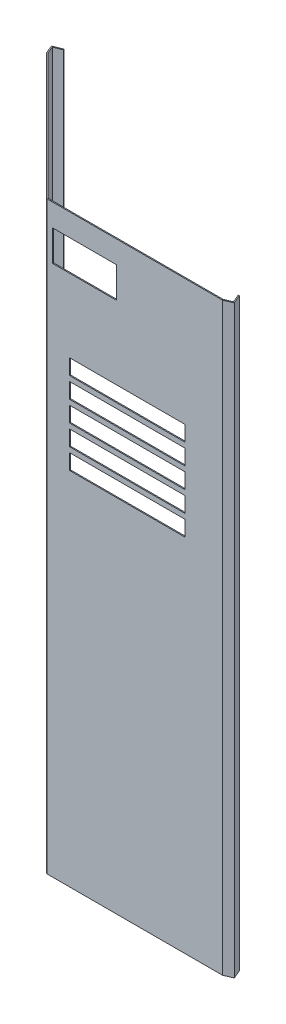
from build123d import *

# Parameters (mm, degrees)
EXTRU_MINCE1_DEPTH      = 2276
CONG_1_R                = 4
CONG_2_R                = 2
ESQUISSE2_W             = 250
ESQUISSE2_H             = 120
ESQUISSE2_W_2           = 450
ESQUISSE2_H_2           = 60
ENL_V_MAT_EXTRU_1_DEPTH = 2624.887483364
ESQUISSE3_W             = 250
ESQUISSE3_H             = 120
ENL_V_MAT_EXTRU_2_DEPTH = 2584.248357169


with BuildPart() as part:
    # Esquisse1 → Extru.-Mince1 (new body)
    with BuildSketch(Plane(origin=(0, 0, 0), x_dir=(1, 0, 0), z_dir=(0, 1, 0))):
        Polygon((17.369886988, 48.654773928), (32.217669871, 13.675589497), (0, 0), (-685, 0), (-1176.439212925, 491.439212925), (-1189.550443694, 523.890647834), (-1154.317457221, 538.125698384), (-1152.819030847, 534.416962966), (-1184.343281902, 521.68033879), (-1173.035335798, 493.692190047), (-683.343145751, 4), (-0.813809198, 4), (26.972725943, 15.794684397), (13.687867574, 47.091849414), align=None)
    extrude(amount=EXTRU_MINCE1_DEPTH)

    # Cong_1
    cong_1_edges = [part.edges().sort_by_distance(p)[0] for p in [
        (-685, 1138, 0),
    ]]
    fillet(cong_1_edges, radius=CONG_1_R)

    # Cong_2
    cong_2_edges = [part.edges().sort_by_distance(p)[0] for p in [
        (-683.343145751, 1138, -4),
    ]]
    fillet(cong_2_edges, radius=CONG_2_R)

    # Esquisse2 → Enl_v. mat.-Extru.1 (cut, through all)
    with BuildSketch(Plane.XY):
        with Locations((-537, 2129)):
            Rectangle(ESQUISSE2_W, ESQUISSE2_H)
        with Locations((-371, 1754)):
            Rectangle(ESQUISSE2_W_2, ESQUISSE2_H_2)
        with Locations((-371, 1674)):
            Rectangle(ESQUISSE2_W_2, ESQUISSE2_H_2)
        with Locations((-371, 1594)):
            Rectangle(ESQUISSE2_W_2, ESQUISSE2_H_2)
        with Locations((-371, 1514)):
            Rectangle(ESQUISSE2_W_2, ESQUISSE2_H_2)
        with Locations((-371, 1434)):
            Rectangle(ESQUISSE2_W_2, ESQUISSE2_H_2)
    extrude(amount=-ENL_V_MAT_EXTRU_1_DEPTH, mode=Mode.SUBTRACT)

    # Esquisse3 → Enl_v. mat.-Extru.2 (cut, through all)
    with BuildSketch(Plane(origin=(-342.5, 0, 342.5), x_dir=(0.7071067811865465, 0, 0.7071067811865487), z_dir=(-0.7071067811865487, 0, 0.7071067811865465))):
        with Locations((-642.368145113, 2129)):
            Rectangle(ESQUISSE3_W, ESQUISSE3_H)
        with Locations((-642.368145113, 1809)):
            Rectangle(ESQUISSE3_W, ESQUISSE3_H)
        with Locations((-972.368145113, 1809)):
            Rectangle(ESQUISSE3_W, ESQUISSE3_H)
        with Locations((-972.368145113, 1489)):
            Rectangle(ESQUISSE3_W, ESQUISSE3_H)
        with Locations((-642.368145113, 1489)):
            Rectangle(ESQUISSE3_W, ESQUISSE3_H)
    extrude(amount=-ENL_V_MAT_EXTRU_2_DEPTH, mode=Mode.SUBTRACT)


solid = part.part
